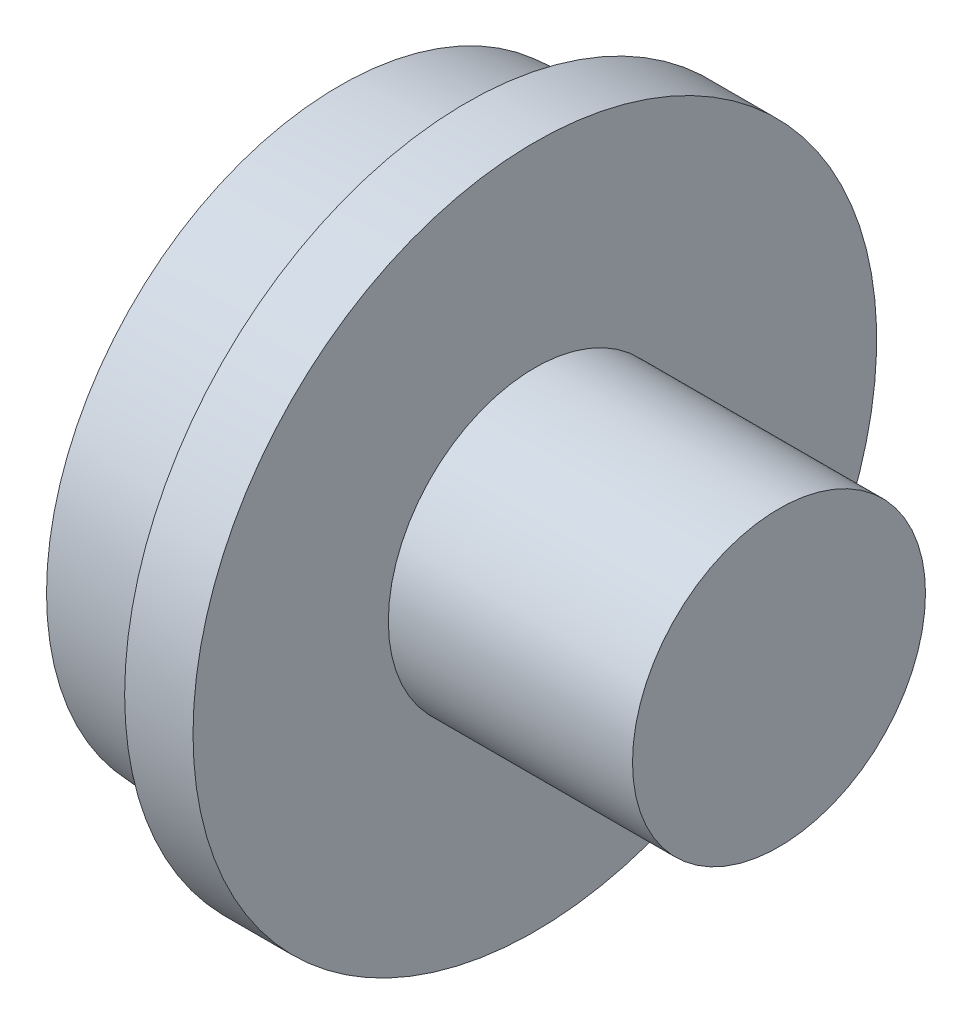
ISO-10303-21;
HEADER;
FILE_DESCRIPTION(('STEP AP214'),'2;1');
FILE_NAME('part.step','',(''),(''),'','','');
FILE_SCHEMA(('AUTOMOTIVE_DESIGN { 1 0 10303 214 1 1 1 1 }'));
ENDSEC;
DATA;
#1=APPLICATION_CONTEXT('core data for automotive mechanical design processes');
#2=APPLICATION_PROTOCOL_DEFINITION('international standard','automotive_design',2000,#1);
#3=PRODUCT_CONTEXT('',#1,'mechanical');
#4=PRODUCT('Part','Part','',(#3));
#5=PRODUCT_RELATED_PRODUCT_CATEGORY('part','',(#4));
#6=PRODUCT_DEFINITION_FORMATION('','',#4);
#7=PRODUCT_DEFINITION_CONTEXT('part definition',#1,'design');
#8=PRODUCT_DEFINITION('design','',#6,#7);
#9=PRODUCT_DEFINITION_SHAPE('','',#8);
#10=(LENGTH_UNIT() NAMED_UNIT(*) SI_UNIT(.MILLI.,.METRE.));
#11=(NAMED_UNIT(*) PLANE_ANGLE_UNIT() SI_UNIT($,.RADIAN.));
#12=(NAMED_UNIT(*) SI_UNIT($,.STERADIAN.) SOLID_ANGLE_UNIT());
#13=UNCERTAINTY_MEASURE_WITH_UNIT(LENGTH_MEASURE(1.E-05),#10,'distance_accuracy_value','');
#14=(GEOMETRIC_REPRESENTATION_CONTEXT(3) GLOBAL_UNCERTAINTY_ASSIGNED_CONTEXT((#13)) GLOBAL_UNIT_ASSIGNED_CONTEXT((#10,
#11,#12)) REPRESENTATION_CONTEXT('',''));
#15=CARTESIAN_POINT('',(0.,0.,0.));
#16=DIRECTION('',(0.,0.,1.));
#17=DIRECTION('',(1.,0.,0.));
#18=AXIS2_PLACEMENT_3D('',#15,#16,#17);
#19=CARTESIAN_POINT('',(0.,30.,0.));
#20=DIRECTION('',(-1.,0.,0.));
#21=DIRECTION('',(0.,0.,1.));
#22=AXIS2_PLACEMENT_3D('',#19,#20,#21);
#23=PLANE('',#22);
#24=CARTESIAN_POINT('',(0.,0.,0.));
#25=DIRECTION('',(-1.,0.,0.));
#26=DIRECTION('',(0.,0.,1.));
#27=AXIS2_PLACEMENT_3D('',#24,#25,#26);
#28=CIRCLE('',#27,30.);
#29=CARTESIAN_POINT('',(0.,0.,30.));
#30=VERTEX_POINT('',#29);
#31=EDGE_CURVE('E10',#30,#30,#28,.T.);
#32=ORIENTED_EDGE('',*,*,#31,.F.);
#33=EDGE_LOOP('',(#32));
#34=FACE_BOUND('',#33,.T.);
#35=ADVANCED_FACE('F29',(#34),#23,.F.);
#36=CARTESIAN_POINT('',(-100.,0.,0.));
#37=DIRECTION('',(-1.,0.,0.));
#38=DIRECTION('',(0.,0.,1.));
#39=AXIS2_PLACEMENT_3D('',#36,#37,#38);
#40=CYLINDRICAL_SURFACE('',#39,30.);
#41=CARTESIAN_POINT('',(-50.,0.,0.));
#42=DIRECTION('',(-1.,0.,0.));
#43=DIRECTION('',(0.,0.,1.));
#44=AXIS2_PLACEMENT_3D('',#41,#42,#43);
#45=CIRCLE('',#44,30.);
#46=CARTESIAN_POINT('',(-50.,0.,30.));
#47=VERTEX_POINT('',#46);
#48=EDGE_CURVE('E35',#47,#47,#45,.T.);
#49=ORIENTED_EDGE('',*,*,#48,.F.);
#50=EDGE_LOOP('',(#49));
#51=FACE_BOUND('',#50,.T.);
#52=ORIENTED_EDGE('',*,*,#31,.T.);
#53=EDGE_LOOP('',(#52));
#54=FACE_BOUND('',#53,.T.);
#55=ADVANCED_FACE('F95',(#51,#54),#40,.T.);
#56=CARTESIAN_POINT('',(-50.,70.,0.));
#57=DIRECTION('',(-1.,0.,0.));
#58=DIRECTION('',(0.,0.,1.));
#59=AXIS2_PLACEMENT_3D('',#56,#57,#58);
#60=PLANE('',#59);
#61=CARTESIAN_POINT('',(-50.,0.,0.));
#62=DIRECTION('',(-1.,0.,0.));
#63=DIRECTION('',(0.,0.,1.));
#64=AXIS2_PLACEMENT_3D('',#61,#62,#63);
#65=CIRCLE('',#64,70.);
#66=CARTESIAN_POINT('',(-50.,0.,70.));
#67=VERTEX_POINT('',#66);
#68=EDGE_CURVE('E39',#67,#67,#65,.T.);
#69=ORIENTED_EDGE('',*,*,#68,.F.);
#70=EDGE_LOOP('',(#69));
#71=FACE_BOUND('',#70,.T.);
#72=ORIENTED_EDGE('',*,*,#48,.T.);
#73=EDGE_LOOP('',(#72));
#74=FACE_BOUND('',#73,.T.);
#75=ADVANCED_FACE('F90',(#71,#74),#60,.F.);
#76=CARTESIAN_POINT('',(-100.,0.,0.));
#77=DIRECTION('',(-1.,0.,0.));
#78=DIRECTION('',(0.,0.,1.));
#79=AXIS2_PLACEMENT_3D('',#76,#77,#78);
#80=CYLINDRICAL_SURFACE('',#79,70.);
#81=CARTESIAN_POINT('',(-64.,0.,0.));
#82=DIRECTION('',(-1.,0.,0.));
#83=DIRECTION('',(0.,0.,1.));
#84=AXIS2_PLACEMENT_3D('',#81,#82,#83);
#85=CIRCLE('',#84,70.);
#86=CARTESIAN_POINT('',(-64.,0.,70.));
#87=VERTEX_POINT('',#86);
#88=EDGE_CURVE('E43',#87,#87,#85,.T.);
#89=ORIENTED_EDGE('',*,*,#88,.F.);
#90=EDGE_LOOP('',(#89));
#91=FACE_BOUND('',#90,.T.);
#92=ORIENTED_EDGE('',*,*,#68,.T.);
#93=EDGE_LOOP('',(#92));
#94=FACE_BOUND('',#93,.T.);
#95=ADVANCED_FACE('F84',(#91,#94),#80,.T.);
#96=CARTESIAN_POINT('',(-64.,70.,0.));
#97=DIRECTION('',(1.,0.,0.));
#98=DIRECTION('',(0.,0.,-1.));
#99=AXIS2_PLACEMENT_3D('',#96,#97,#98);
#100=PLANE('',#99);
#101=CARTESIAN_POINT('',(-64.,0.,0.));
#102=DIRECTION('',(-1.,0.,0.));
#103=DIRECTION('',(0.,0.,1.));
#104=AXIS2_PLACEMENT_3D('',#101,#102,#103);
#105=CIRCLE('',#104,61.9549498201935);
#106=CARTESIAN_POINT('',(-64.,0.,61.9549498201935));
#107=VERTEX_POINT('',#106);
#108=EDGE_CURVE('E48',#107,#107,#105,.T.);
#109=ORIENTED_EDGE('',*,*,#108,.F.);
#110=EDGE_LOOP('',(#109));
#111=FACE_BOUND('',#110,.T.);
#112=ORIENTED_EDGE('',*,*,#88,.T.);
#113=EDGE_LOOP('',(#112));
#114=FACE_BOUND('',#113,.T.);
#115=ADVANCED_FACE('F78',(#111,#114),#100,.F.);
#116=CARTESIAN_POINT('',(-64.,0.,0.));
#117=DIRECTION('',(1.,0.,0.));
#118=DIRECTION('',(0.,0.,-1.));
#119=AXIS2_PLACEMENT_3D('',#116,#117,#118);
#120=CONICAL_SURFACE('',#119,61.9549498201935,0.0750491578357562);
#121=CARTESIAN_POINT('',(-90.,0.,0.));
#122=DIRECTION('',(-1.,0.,0.));
#123=DIRECTION('',(0.,0.,1.));
#124=AXIS2_PLACEMENT_3D('',#121,#122,#123);
#125=CIRCLE('',#124,60.);
#126=CARTESIAN_POINT('',(-90.,0.,60.));
#127=VERTEX_POINT('',#126);
#128=EDGE_CURVE('E51',#127,#127,#125,.T.);
#129=ORIENTED_EDGE('',*,*,#128,.F.);
#130=EDGE_LOOP('',(#129));
#131=FACE_BOUND('',#130,.T.);
#132=ORIENTED_EDGE('',*,*,#108,.T.);
#133=EDGE_LOOP('',(#132));
#134=FACE_BOUND('',#133,.T.);
#135=ADVANCED_FACE('F72',(#131,#134),#120,.T.);
#136=CARTESIAN_POINT('',(-90.,60.,0.));
#137=DIRECTION('',(1.,0.,0.));
#138=DIRECTION('',(0.,0.,-1.));
#139=AXIS2_PLACEMENT_3D('',#136,#137,#138);
#140=PLANE('',#139);
#141=CARTESIAN_POINT('',(-90.,0.,0.));
#142=DIRECTION('',(-1.,0.,0.));
#143=DIRECTION('',(0.,0.,1.));
#144=AXIS2_PLACEMENT_3D('',#141,#142,#143);
#145=CIRCLE('',#144,45.);
#146=CARTESIAN_POINT('',(-90.,0.,45.));
#147=VERTEX_POINT('',#146);
#148=EDGE_CURVE('E54',#147,#147,#145,.T.);
#149=ORIENTED_EDGE('',*,*,#148,.F.);
#150=EDGE_LOOP('',(#149));
#151=FACE_BOUND('',#150,.T.);
#152=ORIENTED_EDGE('',*,*,#128,.T.);
#153=EDGE_LOOP('',(#152));
#154=FACE_BOUND('',#153,.T.);
#155=ADVANCED_FACE('F66',(#151,#154),#140,.F.);
#156=CARTESIAN_POINT('',(-100.,0.,0.));
#157=DIRECTION('',(-1.,0.,0.));
#158=DIRECTION('',(0.,0.,1.));
#159=AXIS2_PLACEMENT_3D('',#156,#157,#158);
#160=CYLINDRICAL_SURFACE('',#159,45.);
#161=CARTESIAN_POINT('',(-100.,0.,0.));
#162=DIRECTION('',(-1.,0.,0.));
#163=DIRECTION('',(0.,0.,1.));
#164=AXIS2_PLACEMENT_3D('',#161,#162,#163);
#165=CIRCLE('',#164,45.);
#166=CARTESIAN_POINT('',(-100.,0.,45.));
#167=VERTEX_POINT('',#166);
#168=EDGE_CURVE('E57',#167,#167,#165,.T.);
#169=ORIENTED_EDGE('',*,*,#168,.F.);
#170=EDGE_LOOP('',(#169));
#171=FACE_BOUND('',#170,.T.);
#172=ORIENTED_EDGE('',*,*,#148,.T.);
#173=EDGE_LOOP('',(#172));
#174=FACE_BOUND('',#173,.T.);
#175=ADVANCED_FACE('F63',(#171,#174),#160,.T.);
#176=CARTESIAN_POINT('',(-100.,45.,0.));
#177=DIRECTION('',(1.,0.,0.));
#178=DIRECTION('',(0.,0.,-1.));
#179=AXIS2_PLACEMENT_3D('',#176,#177,#178);
#180=PLANE('',#179);
#181=ORIENTED_EDGE('',*,*,#168,.T.);
#182=EDGE_LOOP('',(#181));
#183=FACE_BOUND('',#182,.T.);
#184=ADVANCED_FACE('F61',(#183),#180,.F.);
#185=CLOSED_SHELL('',(#35,#55,#75,#95,#115,#135,#155,#175,#184));
#186=MANIFOLD_SOLID_BREP('B2',#185);
#187=ADVANCED_BREP_SHAPE_REPRESENTATION('',(#18,#186),#14);
#188=SHAPE_DEFINITION_REPRESENTATION(#9,#187);
ENDSEC;
END-ISO-10303-21;
